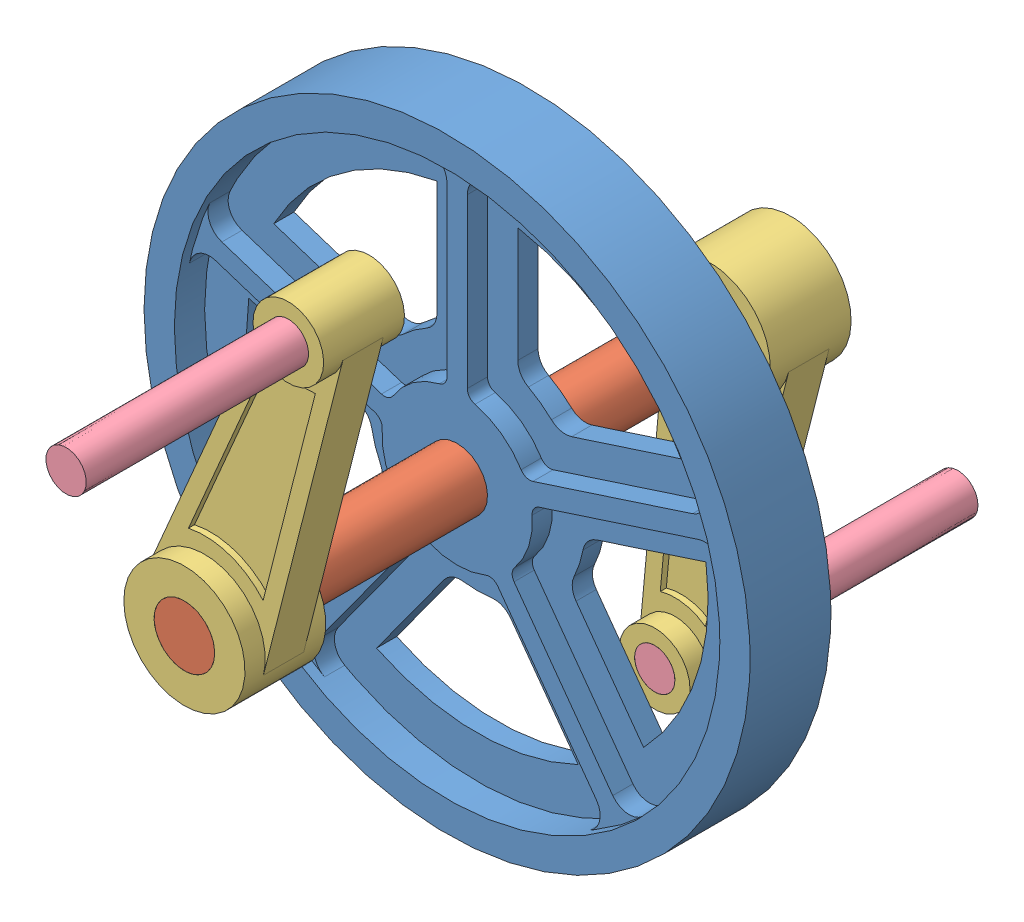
SolidWorks assembly ensamblaje.SLDASM, configuration Predeterminado (file format 4400). Lengths in mm.
Overall size (300 357.74 520).
6 component instances, 4 part files, 11 mates.
Components (placement in the parent):
- Pieza1-1: Pieza1.SLDPRT [Predeterminado] at (33.3268 1.0254 0) size (300 300 40)
- Pieza2-1: Pieza2.SLDPRT [Predeterminado] at (33.3268 1.0254 -150) x (0.741977 -0.670425 0) z (0 0 1) size (30 30 300)
- Pieza3-1: Pieza3.SLDPRT [Predeterminado] at (33.3268 1.0254 130) x (0.946915 -0.321485 0) z (-0.321485 -0.946915 0) size (60 40 207.5)
- Pieza3-2: Pieza3.SLDPRT [Predeterminado] at (33.3268 1.0254 -130) x (0.985434 -0.170057 0) z (0.170057 0.985434 0) size (60 40 207.5)
- Pieza4-1: Pieza4.SLDPRT [Predeterminado] at (84.7643 152.5318 110) x (0.914031 -0.405644 0) z (0 0 1) size (20 20 150)
- Pieza4-2: Pieza4.SLDPRT [Predeterminado] at (6.1176 -156.644 -260) x (0.974242 0.225507 0) z (0 0 1) size (20 20 150)
Mates (geometry in assembly coordinates):
- Concéntrica1: concentric aligned: cylinder of Pieza1-1 through (33.3268 1.0254 20) axis (0 0 -1) radius 15; cylinder of Pieza2-1 through (33.3268 1.0254 150) axis (0 0 -1) radius 15
- Simétrico1: symmetric aligned: plane of Pieza2-1 through (33.3268 1.0254 150) normal (0 0 1); plane of Pieza2-1 through (33.3268 1.0254 -150) normal (0 0 -1); plane of assembly through (0 0 0) normal (0 0 1)
- Concéntrica2: concentric aligned: cylinder of Pieza2-1 through (33.3268 1.0254 150) axis (0 0 -1) radius 15; cylinder of Pieza3-1 through (33.3268 1.0254 150) axis (0 0 -1) radius 15
- Coincidente1: coincident aligned: plane of Pieza2-1 through (33.3268 1.0254 150) normal (0 0 1); plane of Pieza3-1 through (-112.4936 112.6052 150) normal (0 0 1)
- Concéntrica3: concentric anti-aligned: cylinder of Pieza2-1 through (33.3268 1.0254 150) axis (0 0 -1) radius 15; cylinder of Pieza3-2 through (33.3268 1.0254 -150) axis (0 0 1) radius 15
- Coincidente2: coincident aligned: plane of Pieza2-1 through (33.3268 1.0254 -150) normal (0 0 -1); plane of Pieza3-2 through (-140.3835 -58.4588 -150) normal (0 0 -1)
- Coincidente3: coincident aligned: plane of Pieza3-1 through (76.8807 81.7301 140) normal (0.986969 -0.160913 0); plane of Pieza3-2 through (48.9909 -89.334 -140) normal (0.986969 -0.160913 0)
- Concéntrica5: concentric: cylinder of Pieza3-1 through (71.3312 156.4463 110) axis (0 0 1) radius 10; cylinder of Pieza4-1 through (71.3312 156.4463 260) axis (0 0 -1) radius 10
- Coincidente4: coincident aligned: plane of Pieza3-1 through (84.7643 152.5318 110) normal (0 0 -1); plane of Pieza4-1 through (84.7643 152.5318 110) normal (0 0 -1)
- Concéntrica6: concentric: cylinder of Pieza3-2 through (6.1176 -156.644 -110) axis (0 0 -1) radius 10; cylinder of Pieza4-2 through (6.1176 -156.644 -110) axis (0 0 -1) radius 10
- Coincidente5: coincident aligned: plane of Pieza3-2 through (6.1176 -156.644 -110) normal (0 0 1); plane of Pieza4-2 through (6.1176 -156.644 -110) normal (0 0 1)
